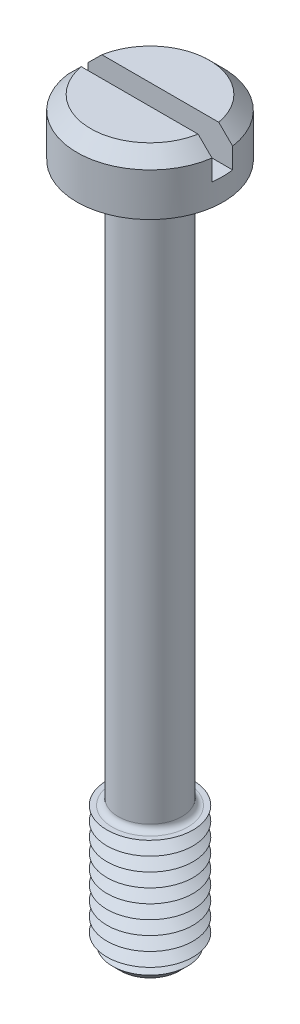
from build123d import *

# Parameters (mm, degrees)
SKETCH1_R           = 4.25
BOSS_EXTRUDE1_DEPTH = 3.3
SKETCH2_R           = 1.85
BOSS_EXTRUDE2_DEPTH = 40
SKETCH3_R           = 2.5
BOSS_EXTRUDE3_DEPTH = 7.5
CHAMFER1_SIZE       = 0.8
LPATTERN1_COUNT     = 9
LPATTERN1_PITCH     = 0.8
FILLET1_R           = 0.35
CHAMFER2_SIZE       = 0.8
SKETCH6_W           = 8.5
SKETCH6_H           = 1.2
CUT_EXTRUDE1_DEPTH  = 2


with BuildPart() as part:
    # Sketch1 → Boss-Extrude1 (new body)
    with BuildSketch(Plane(origin=(0, 0, 0), x_dir=(1, 0, 0), z_dir=(0, 1, 0))):
        with Locations(Location((0, 0, 0), (0, 0, 270))):
            Circle(SKETCH1_R)
    extrude(amount=BOSS_EXTRUDE1_DEPTH)

    # Sketch2 → Boss-Extrude2 (add)
    with BuildSketch(Plane.XZ):
        with Locations(Location((0, 0, 0), (0, 0, 270))):
            Circle(SKETCH2_R)
    extrude(amount=BOSS_EXTRUDE2_DEPTH)

    # Sketch3 → Boss-Extrude3 (add)
    with BuildSketch(Plane.XZ.offset(40)):
        with Locations(Location((0, 0, 0), (0, 0, 270))):
            Circle(SKETCH3_R)
    extrude(amount=-BOSS_EXTRUDE3_DEPTH)

    # Chamfer1
    chamfer1_edges = [part.edges().sort_by_distance(p)[0] for p in [
        (0, -40, 2.5),
    ]]
    chamfer(chamfer1_edges, length=CHAMFER1_SIZE)

    # Sketch5 → Cut-Revolve1 (revolve, cut)
    with BuildSketch(Plane(origin=(0, 0, 0), x_dir=(0, 0, -1), z_dir=(1, 0, 0))):
        Polygon((-2.5, -32.5), (-1.807179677, -32.9), (-2.5, -33.3), align=None)
    cut_revolve1 = revolve(axis=Axis((0, -6.58711856, 0), (0, -1, 0)), mode=Mode.SUBTRACT)

    # LPattern1: Cut-Revolve1 ×9
    with Locations(*[(0, -i * LPATTERN1_PITCH, 0) for i in range(1, LPATTERN1_COUNT)]):
        add(cut_revolve1, mode=Mode.SUBTRACT)

    # Fillet1
    fillet1_edges = [part.edges().sort_by_distance(p)[0] for p in [
        (0, 0, 1.85),
        (0, -32.5, 1.85),
    ]]
    fillet(fillet1_edges, radius=FILLET1_R)

    # Chamfer2
    chamfer2_edges = [part.edges().sort_by_distance(p)[0] for p in [
        (0, 3.3, -4.25),
    ]]
    chamfer(chamfer2_edges, length=CHAMFER2_SIZE)

    # Sketch6 → Cut-Extrude1 (cut)
    with BuildSketch(Plane(origin=(0, 3.3, 0), x_dir=(1, 0, 0), z_dir=(0, 1, 0))):
        Rectangle(SKETCH6_W, SKETCH6_H)
    extrude(amount=-CUT_EXTRUDE1_DEPTH, mode=Mode.SUBTRACT)


solid = part.part
